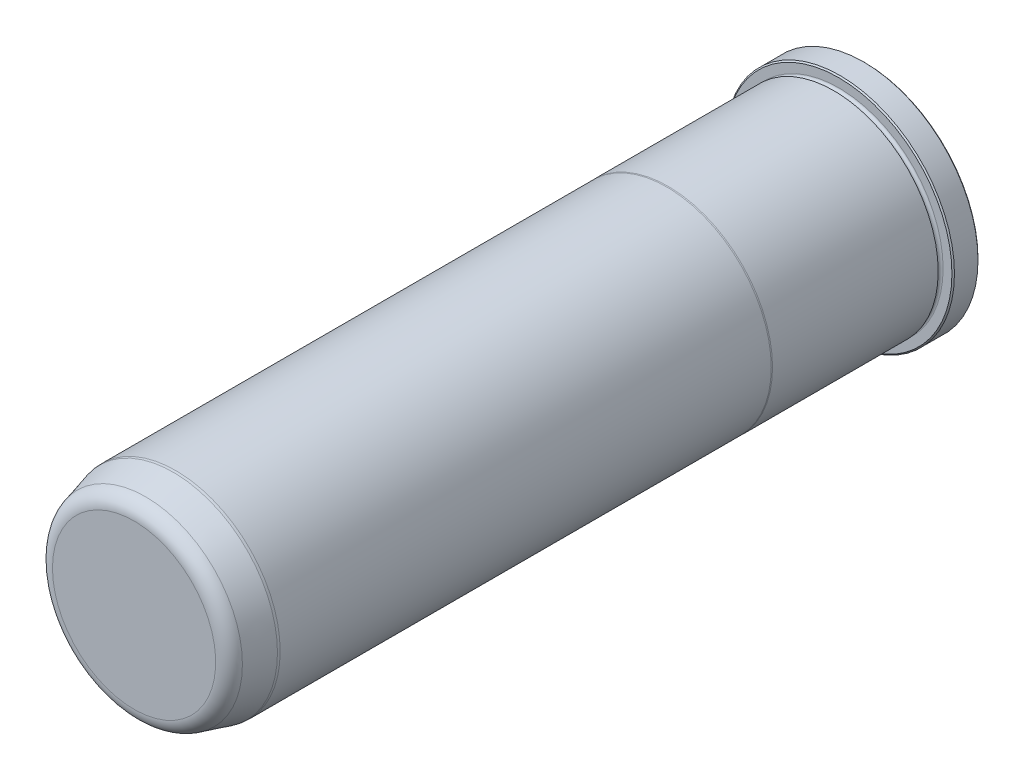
ISO-10303-21;
HEADER;
FILE_DESCRIPTION(('STEP AP214'),'2;1');
FILE_NAME('part.step','',(''),(''),'','','');
FILE_SCHEMA(('AUTOMOTIVE_DESIGN { 1 0 10303 214 1 1 1 1 }'));
ENDSEC;
DATA;
#1=APPLICATION_CONTEXT('core data for automotive mechanical design processes');
#2=APPLICATION_PROTOCOL_DEFINITION('international standard','automotive_design',2000,#1);
#3=PRODUCT_CONTEXT('',#1,'mechanical');
#4=PRODUCT('Part','Part','',(#3));
#5=PRODUCT_RELATED_PRODUCT_CATEGORY('part','',(#4));
#6=PRODUCT_DEFINITION_FORMATION('','',#4);
#7=PRODUCT_DEFINITION_CONTEXT('part definition',#1,'design');
#8=PRODUCT_DEFINITION('design','',#6,#7);
#9=PRODUCT_DEFINITION_SHAPE('','',#8);
#10=(LENGTH_UNIT() NAMED_UNIT(*) SI_UNIT(.MILLI.,.METRE.));
#11=(NAMED_UNIT(*) PLANE_ANGLE_UNIT() SI_UNIT($,.RADIAN.));
#12=(NAMED_UNIT(*) SI_UNIT($,.STERADIAN.) SOLID_ANGLE_UNIT());
#13=UNCERTAINTY_MEASURE_WITH_UNIT(LENGTH_MEASURE(1.E-05),#10,'distance_accuracy_value','');
#14=(GEOMETRIC_REPRESENTATION_CONTEXT(3) GLOBAL_UNCERTAINTY_ASSIGNED_CONTEXT((#13)) GLOBAL_UNIT_ASSIGNED_CONTEXT((#10,
#11,#12)) REPRESENTATION_CONTEXT('',''));
#15=CARTESIAN_POINT('',(0.,0.,0.));
#16=DIRECTION('',(0.,0.,1.));
#17=DIRECTION('',(1.,0.,0.));
#18=AXIS2_PLACEMENT_3D('',#15,#16,#17);
#19=CARTESIAN_POINT('',(0.,0.,0.));
#20=DIRECTION('',(0.,0.,1.));
#21=DIRECTION('',(1.,0.,0.));
#22=AXIS2_PLACEMENT_3D('',#19,#20,#21);
#23=PLANE('',#22);
#24=CARTESIAN_POINT('',(0.,0.,0.));
#25=DIRECTION('',(0.,0.,1.));
#26=DIRECTION('',(1.,0.,0.));
#27=AXIS2_PLACEMENT_3D('',#24,#25,#26);
#28=CIRCLE('',#27,34.417);
#29=CARTESIAN_POINT('',(34.417,0.,0.));
#30=VERTEX_POINT('',#29);
#31=EDGE_CURVE('E37',#30,#30,#28,.F.);
#32=ORIENTED_EDGE('',*,*,#31,.T.);
#33=EDGE_LOOP('',(#32));
#34=FACE_BOUND('',#33,.T.);
#35=ADVANCED_FACE('F30',(#34),#23,.F.);
#36=CARTESIAN_POINT('',(0.,0.,0.));
#37=DIRECTION('',(0.,0.,1.));
#38=DIRECTION('',(1.,0.,0.));
#39=AXIS2_PLACEMENT_3D('',#36,#37,#38);
#40=CYLINDRICAL_SURFACE('',#39,34.798);
#41=CARTESIAN_POINT('',(0.,0.,0.381000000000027));
#42=DIRECTION('',(0.,0.,1.));
#43=DIRECTION('',(1.,0.,0.));
#44=AXIS2_PLACEMENT_3D('',#41,#42,#43);
#45=CIRCLE('',#44,34.798);
#46=CARTESIAN_POINT('',(34.798,0.,0.381000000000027));
#47=VERTEX_POINT('',#46);
#48=EDGE_CURVE('E41',#47,#47,#45,.T.);
#49=ORIENTED_EDGE('',*,*,#48,.T.);
#50=EDGE_LOOP('',(#49));
#51=FACE_BOUND('',#50,.T.);
#52=CARTESIAN_POINT('',(0.,0.,7.54380000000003));
#53=DIRECTION('',(0.,0.,-1.));
#54=DIRECTION('',(-1.,0.,0.));
#55=AXIS2_PLACEMENT_3D('',#52,#53,#54);
#56=CIRCLE('',#55,34.798);
#57=CARTESIAN_POINT('',(-34.798,0.,7.54380000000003));
#58=VERTEX_POINT('',#57);
#59=EDGE_CURVE('E45',#58,#58,#56,.T.);
#60=ORIENTED_EDGE('',*,*,#59,.T.);
#61=EDGE_LOOP('',(#60));
#62=FACE_BOUND('',#61,.T.);
#63=ADVANCED_FACE('F118',(#51,#62),#40,.T.);
#64=CARTESIAN_POINT('',(0.,34.798,7.9248));
#65=DIRECTION('',(0.,0.,-1.));
#66=DIRECTION('',(-1.,0.,0.));
#67=AXIS2_PLACEMENT_3D('',#64,#65,#66);
#68=PLANE('',#67);
#69=CARTESIAN_POINT('',(0.,0.,7.9248));
#70=DIRECTION('',(0.,0.,-1.));
#71=DIRECTION('',(-1.,0.,0.));
#72=AXIS2_PLACEMENT_3D('',#69,#70,#71);
#73=CIRCLE('',#72,34.417);
#74=CARTESIAN_POINT('',(-34.417,0.,7.9248));
#75=VERTEX_POINT('',#74);
#76=EDGE_CURVE('E10',#75,#75,#73,.F.);
#77=ORIENTED_EDGE('',*,*,#76,.T.);
#78=EDGE_LOOP('',(#77));
#79=FACE_BOUND('',#78,.T.);
#80=CARTESIAN_POINT('',(0.,0.,7.9248));
#81=DIRECTION('',(0.,0.,1.));
#82=DIRECTION('',(1.,0.,0.));
#83=AXIS2_PLACEMENT_3D('',#80,#81,#82);
#84=CIRCLE('',#83,31.7373);
#85=CARTESIAN_POINT('',(31.7373,0.,7.9248));
#86=VERTEX_POINT('',#85);
#87=EDGE_CURVE('E56',#86,#86,#84,.T.);
#88=ORIENTED_EDGE('',*,*,#87,.F.);
#89=EDGE_LOOP('',(#88));
#90=FACE_BOUND('',#89,.T.);
#91=ADVANCED_FACE('F113',(#79,#90),#68,.F.);
#92=CARTESIAN_POINT('',(0.,0.,8.6868));
#93=DIRECTION('',(0.,0.,1.));
#94=DIRECTION('',(1.,0.,0.));
#95=AXIS2_PLACEMENT_3D('',#92,#93,#94);
#96=TOROIDAL_SURFACE('',#95,31.7373,0.761999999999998);
#97=CARTESIAN_POINT('',(0.,0.,9.44879999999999));
#98=DIRECTION('',(0.,0.,1.));
#99=DIRECTION('',(1.,0.,0.));
#100=AXIS2_PLACEMENT_3D('',#97,#98,#99);
#101=CIRCLE('',#100,31.7373);
#102=CARTESIAN_POINT('',(31.7373,0.,9.44879999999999));
#103=VERTEX_POINT('',#102);
#104=EDGE_CURVE('E59',#103,#103,#101,.T.);
#105=ORIENTED_EDGE('',*,*,#104,.F.);
#106=EDGE_LOOP('',(#105));
#107=FACE_BOUND('',#106,.T.);
#108=ORIENTED_EDGE('',*,*,#87,.T.);
#109=EDGE_LOOP('',(#108));
#110=FACE_BOUND('',#109,.T.);
#111=ADVANCED_FACE('F107',(#107,#110),#96,.F.);
#112=CARTESIAN_POINT('',(0.,31.7373,9.44879999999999));
#113=DIRECTION('',(0.,0.,1.));
#114=DIRECTION('',(1.,0.,0.));
#115=AXIS2_PLACEMENT_3D('',#112,#113,#114);
#116=PLANE('',#115);
#117=CARTESIAN_POINT('',(0.,0.,9.4488));
#118=DIRECTION('',(0.,0.,1.));
#119=DIRECTION('',(1.,0.,0.));
#120=AXIS2_PLACEMENT_3D('',#117,#118,#119);
#121=CIRCLE('',#120,31.7627);
#122=CARTESIAN_POINT('',(31.7627,0.,9.4488));
#123=VERTEX_POINT('',#122);
#124=EDGE_CURVE('E62',#123,#123,#121,.T.);
#125=ORIENTED_EDGE('',*,*,#124,.F.);
#126=EDGE_LOOP('',(#125));
#127=FACE_BOUND('',#126,.T.);
#128=ORIENTED_EDGE('',*,*,#104,.T.);
#129=EDGE_LOOP('',(#128));
#130=FACE_BOUND('',#129,.T.);
#131=ADVANCED_FACE('F101',(#127,#130),#116,.F.);
#132=CARTESIAN_POINT('',(0.,0.,0.));
#133=DIRECTION('',(0.,0.,1.));
#134=DIRECTION('',(1.,0.,0.));
#135=AXIS2_PLACEMENT_3D('',#132,#133,#134);
#136=CYLINDRICAL_SURFACE('',#135,31.7627);
#137=CARTESIAN_POINT('',(0.,0.,59.8347630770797));
#138=DIRECTION('',(0.,0.,1.));
#139=DIRECTION('',(1.,0.,0.));
#140=AXIS2_PLACEMENT_3D('',#137,#138,#139);
#141=CIRCLE('',#140,31.7627);
#142=CARTESIAN_POINT('',(31.7627,0.,59.8347630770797));
#143=VERTEX_POINT('',#142);
#144=EDGE_CURVE('E65',#143,#143,#141,.T.);
#145=ORIENTED_EDGE('',*,*,#144,.F.);
#146=EDGE_LOOP('',(#145));
#147=FACE_BOUND('',#146,.T.);
#148=ORIENTED_EDGE('',*,*,#124,.T.);
#149=EDGE_LOOP('',(#148));
#150=FACE_BOUND('',#149,.T.);
#151=ADVANCED_FACE('F95',(#147,#150),#136,.T.);
#152=CARTESIAN_POINT('',(0.,0.,59.8347630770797));
#153=DIRECTION('',(0.,0.,-1.));
#154=DIRECTION('',(-1.,0.,0.));
#155=AXIS2_PLACEMENT_3D('',#152,#153,#154);
#156=CONICAL_SURFACE('',#155,31.7627,0.0698131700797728);
#157=CARTESIAN_POINT('',(0.,0.,60.198));
#158=DIRECTION('',(0.,0.,1.));
#159=DIRECTION('',(1.,0.,0.));
#160=AXIS2_PLACEMENT_3D('',#157,#158,#159);
#161=CIRCLE('',#160,31.7373);
#162=CARTESIAN_POINT('',(31.7373,0.,60.198));
#163=VERTEX_POINT('',#162);
#164=EDGE_CURVE('E68',#163,#163,#161,.T.);
#165=ORIENTED_EDGE('',*,*,#164,.F.);
#166=EDGE_LOOP('',(#165));
#167=FACE_BOUND('',#166,.T.);
#168=ORIENTED_EDGE('',*,*,#144,.T.);
#169=EDGE_LOOP('',(#168));
#170=FACE_BOUND('',#169,.T.);
#171=ADVANCED_FACE('F89',(#167,#170),#156,.T.);
#172=CARTESIAN_POINT('',(0.,0.,0.));
#173=DIRECTION('',(0.,0.,1.));
#174=DIRECTION('',(1.,0.,0.));
#175=AXIS2_PLACEMENT_3D('',#172,#173,#174);
#176=CYLINDRICAL_SURFACE('',#175,31.7373);
#177=CARTESIAN_POINT('',(0.,0.,209.55));
#178=DIRECTION('',(0.,0.,1.));
#179=DIRECTION('',(1.,0.,0.));
#180=AXIS2_PLACEMENT_3D('',#177,#178,#179);
#181=CIRCLE('',#180,31.7373);
#182=CARTESIAN_POINT('',(31.7373,0.,209.55));
#183=VERTEX_POINT('',#182);
#184=EDGE_CURVE('E71',#183,#183,#181,.T.);
#185=ORIENTED_EDGE('',*,*,#184,.F.);
#186=EDGE_LOOP('',(#185));
#187=FACE_BOUND('',#186,.T.);
#188=ORIENTED_EDGE('',*,*,#164,.T.);
#189=EDGE_LOOP('',(#188));
#190=FACE_BOUND('',#189,.T.);
#191=ADVANCED_FACE('F83',(#187,#190),#176,.T.);
#192=CARTESIAN_POINT('',(0.,0.,209.55));
#193=DIRECTION('',(0.,0.,-1.));
#194=DIRECTION('',(-1.,0.,0.));
#195=AXIS2_PLACEMENT_3D('',#192,#193,#194);
#196=CONICAL_SURFACE('',#195,31.7373,0.0872664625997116);
#197=CARTESIAN_POINT('',(0.,0.,210.312));
#198=DIRECTION('',(0.,0.,1.));
#199=DIRECTION('',(1.,0.,0.));
#200=AXIS2_PLACEMENT_3D('',#197,#198,#199);
#201=CIRCLE('',#200,31.6706336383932);
#202=CARTESIAN_POINT('',(31.6706336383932,0.,210.312));
#203=VERTEX_POINT('',#202);
#204=EDGE_CURVE('E74',#203,#203,#201,.T.);
#205=ORIENTED_EDGE('',*,*,#204,.F.);
#206=EDGE_LOOP('',(#205));
#207=FACE_BOUND('',#206,.T.);
#208=ORIENTED_EDGE('',*,*,#184,.T.);
#209=EDGE_LOOP('',(#208));
#210=FACE_BOUND('',#209,.T.);
#211=ADVANCED_FACE('F80',(#207,#210),#196,.T.);
#212=CARTESIAN_POINT('',(0.,0.,210.312));
#213=DIRECTION('',(0.,0.,-1.));
#214=DIRECTION('',(-1.,0.,0.));
#215=AXIS2_PLACEMENT_3D('',#212,#213,#214);
#216=CONICAL_SURFACE('',#215,31.6706336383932,0.26179938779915);
#217=CARTESIAN_POINT('',(0.,0.,218.720125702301));
#218=DIRECTION('',(0.,0.,1.));
#219=DIRECTION('',(1.,0.,0.));
#220=AXIS2_PLACEMENT_3D('',#217,#218,#219);
#221=CIRCLE('',#220,29.4176831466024);
#222=CARTESIAN_POINT('',(29.4176831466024,0.,218.720125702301));
#223=VERTEX_POINT('',#222);
#224=EDGE_CURVE('E50',#223,#223,#221,.F.);
#225=ORIENTED_EDGE('',*,*,#224,.T.);
#226=EDGE_LOOP('',(#225));
#227=FACE_BOUND('',#226,.T.);
#228=ORIENTED_EDGE('',*,*,#204,.T.);
#229=EDGE_LOOP('',(#228));
#230=FACE_BOUND('',#229,.T.);
#231=ADVANCED_FACE('F78',(#227,#230),#216,.T.);
#232=CARTESIAN_POINT('',(0.,28.4718561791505,222.25));
#233=DIRECTION('',(0.,0.,-1.));
#234=DIRECTION('',(-1.,0.,0.));
#235=AXIS2_PLACEMENT_3D('',#232,#233,#234);
#236=PLANE('',#235);
#237=CARTESIAN_POINT('',(0.,0.,222.25));
#238=DIRECTION('',(0.,0.,-1.));
#239=DIRECTION('',(-1.,0.,0.));
#240=AXIS2_PLACEMENT_3D('',#237,#238,#239);
#241=CIRCLE('',#240,24.8174613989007);
#242=CARTESIAN_POINT('',(-24.8174613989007,0.,222.25));
#243=VERTEX_POINT('',#242);
#244=EDGE_CURVE('E53',#243,#243,#241,.F.);
#245=ORIENTED_EDGE('',*,*,#244,.T.);
#246=EDGE_LOOP('',(#245));
#247=FACE_BOUND('',#246,.T.);
#248=ADVANCED_FACE('F133',(#247),#236,.F.);
#249=CARTESIAN_POINT('',(0.,0.,217.4875));
#250=DIRECTION('',(0.,0.,-1.));
#251=DIRECTION('',(-1.,0.,0.));
#252=AXIS2_PLACEMENT_3D('',#249,#250,#251);
#253=TOROIDAL_SURFACE('',#252,24.8174613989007,4.7625);
#254=ORIENTED_EDGE('',*,*,#224,.F.);
#255=EDGE_LOOP('',(#254));
#256=FACE_BOUND('',#255,.T.);
#257=ORIENTED_EDGE('',*,*,#244,.F.);
#258=EDGE_LOOP('',(#257));
#259=FACE_BOUND('',#258,.T.);
#260=ADVANCED_FACE('F130',(#256,#259),#253,.T.);
#261=CARTESIAN_POINT('',(0.,0.,0.381000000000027));
#262=DIRECTION('',(0.,0.,1.));
#263=DIRECTION('',(1.,0.,0.));
#264=AXIS2_PLACEMENT_3D('',#261,#262,#263);
#265=CONICAL_SURFACE('',#264,34.798,0.785398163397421);
#266=ORIENTED_EDGE('',*,*,#31,.F.);
#267=EDGE_LOOP('',(#266));
#268=FACE_BOUND('',#267,.T.);
#269=ORIENTED_EDGE('',*,*,#48,.F.);
#270=EDGE_LOOP('',(#269));
#271=FACE_BOUND('',#270,.T.);
#272=ADVANCED_FACE('F132',(#268,#271),#265,.T.);
#273=CARTESIAN_POINT('',(0.,0.,7.9248));
#274=DIRECTION('',(0.,0.,-1.));
#275=DIRECTION('',(-1.,0.,0.));
#276=AXIS2_PLACEMENT_3D('',#273,#274,#275);
#277=CONICAL_SURFACE('',#276,34.417,0.785398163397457);
#278=ORIENTED_EDGE('',*,*,#59,.F.);
#279=EDGE_LOOP('',(#278));
#280=FACE_BOUND('',#279,.T.);
#281=ORIENTED_EDGE('',*,*,#76,.F.);
#282=EDGE_LOOP('',(#281));
#283=FACE_BOUND('',#282,.T.);
#284=ADVANCED_FACE('F32',(#280,#283),#277,.T.);
#285=CLOSED_SHELL('',(#35,#63,#91,#111,#131,#151,#171,#191,#211,#231,#248,#260,#272,#284));
#286=MANIFOLD_SOLID_BREP('B2',#285);
#287=ADVANCED_BREP_SHAPE_REPRESENTATION('',(#18,#286),#14);
#288=SHAPE_DEFINITION_REPRESENTATION(#9,#287);
ENDSEC;
END-ISO-10303-21;
